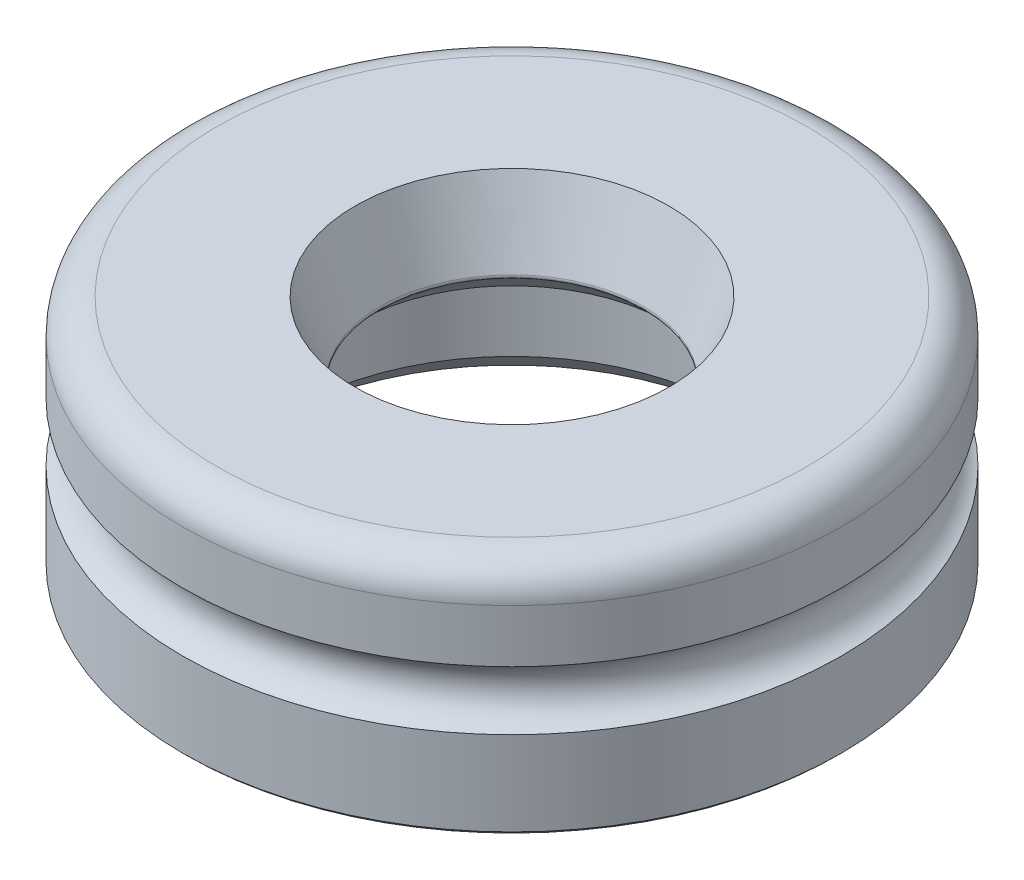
ISO-10303-21;
HEADER;
FILE_DESCRIPTION(('STEP AP214'),'2;1');
FILE_NAME('part.step','',(''),(''),'','','');
FILE_SCHEMA(('AUTOMOTIVE_DESIGN { 1 0 10303 214 1 1 1 1 }'));
ENDSEC;
DATA;
#1=APPLICATION_CONTEXT('core data for automotive mechanical design processes');
#2=APPLICATION_PROTOCOL_DEFINITION('international standard','automotive_design',2000,#1);
#3=PRODUCT_CONTEXT('',#1,'mechanical');
#4=PRODUCT('Part','Part','',(#3));
#5=PRODUCT_RELATED_PRODUCT_CATEGORY('part','',(#4));
#6=PRODUCT_DEFINITION_FORMATION('','',#4);
#7=PRODUCT_DEFINITION_CONTEXT('part definition',#1,'design');
#8=PRODUCT_DEFINITION('design','',#6,#7);
#9=PRODUCT_DEFINITION_SHAPE('','',#8);
#10=(LENGTH_UNIT() NAMED_UNIT(*) SI_UNIT(.MILLI.,.METRE.));
#11=(NAMED_UNIT(*) PLANE_ANGLE_UNIT() SI_UNIT($,.RADIAN.));
#12=(NAMED_UNIT(*) SI_UNIT($,.STERADIAN.) SOLID_ANGLE_UNIT());
#13=UNCERTAINTY_MEASURE_WITH_UNIT(LENGTH_MEASURE(1.E-05),#10,'distance_accuracy_value','');
#14=(GEOMETRIC_REPRESENTATION_CONTEXT(3) GLOBAL_UNCERTAINTY_ASSIGNED_CONTEXT((#13)) GLOBAL_UNIT_ASSIGNED_CONTEXT((#10,
#11,#12)) REPRESENTATION_CONTEXT('',''));
#15=CARTESIAN_POINT('',(0.,0.,0.));
#16=DIRECTION('',(0.,0.,1.));
#17=DIRECTION('',(1.,0.,0.));
#18=AXIS2_PLACEMENT_3D('',#15,#16,#17);
#19=CARTESIAN_POINT('',(0.,0.,0.));
#20=DIRECTION('',(0.,-1.,0.));
#21=DIRECTION('',(0.,0.,-1.));
#22=AXIS2_PLACEMENT_3D('',#19,#20,#21);
#23=CYLINDRICAL_SURFACE('',#22,19.);
#24=CARTESIAN_POINT('',(0.,0.700000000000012,0.));
#25=DIRECTION('',(0.,1.,0.));
#26=DIRECTION('',(0.,0.,1.));
#27=AXIS2_PLACEMENT_3D('',#24,#25,#26);
#28=CIRCLE('',#27,19.);
#29=CARTESIAN_POINT('',(0.,0.700000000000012,19.));
#30=VERTEX_POINT('',#29);
#31=EDGE_CURVE('E10',#30,#30,#28,.T.);
#32=ORIENTED_EDGE('',*,*,#31,.T.);
#33=EDGE_LOOP('',(#32));
#34=FACE_BOUND('',#33,.T.);
#35=CARTESIAN_POINT('',(0.,5.55294372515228,0.));
#36=DIRECTION('',(0.,1.,0.));
#37=DIRECTION('',(0.,0.,1.));
#38=AXIS2_PLACEMENT_3D('',#35,#36,#37);
#39=CIRCLE('',#38,19.);
#40=CARTESIAN_POINT('',(0.,5.55294372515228,19.));
#41=VERTEX_POINT('',#40);
#42=EDGE_CURVE('E48',#41,#41,#39,.T.);
#43=ORIENTED_EDGE('',*,*,#42,.F.);
#44=EDGE_LOOP('',(#43));
#45=FACE_BOUND('',#44,.T.);
#46=ADVANCED_FACE('F30',(#34,#45),#23,.T.);
#47=CARTESIAN_POINT('',(0.,12.,0.));
#48=DIRECTION('',(0.,-1.,0.));
#49=DIRECTION('',(0.,0.,-1.));
#50=AXIS2_PLACEMENT_3D('',#47,#48,#49);
#51=CIRCLE('',#50,19.);
#52=CARTESIAN_POINT('',(0.,12.,-19.));
#53=VERTEX_POINT('',#52);
#54=EDGE_CURVE('E60',#53,#53,#51,.T.);
#55=ORIENTED_EDGE('',*,*,#54,.T.);
#56=EDGE_LOOP('',(#55));
#57=FACE_BOUND('',#56,.T.);
#58=CARTESIAN_POINT('',(0.,8.94705627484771,0.));
#59=DIRECTION('',(0.,-1.,0.));
#60=DIRECTION('',(0.,0.,-1.));
#61=AXIS2_PLACEMENT_3D('',#58,#59,#60);
#62=CIRCLE('',#61,19.);
#63=CARTESIAN_POINT('',(0.,8.94705627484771,-19.));
#64=VERTEX_POINT('',#63);
#65=EDGE_CURVE('E52',#64,#64,#62,.T.);
#66=ORIENTED_EDGE('',*,*,#65,.F.);
#67=EDGE_LOOP('',(#66));
#68=FACE_BOUND('',#67,.T.);
#69=ADVANCED_FACE('F99',(#57,#68),#23,.T.);
#70=CARTESIAN_POINT('',(-19.,0.499999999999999,0.));
#71=DIRECTION('',(0.,1.,0.));
#72=DIRECTION('',(0.,0.,1.));
#73=AXIS2_PLACEMENT_3D('',#70,#71,#72);
#74=PLANE('',#73);
#75=CARTESIAN_POINT('',(0.,0.499999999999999,0.));
#76=DIRECTION('',(0.,1.,0.));
#77=DIRECTION('',(0.,0.,1.));
#78=AXIS2_PLACEMENT_3D('',#75,#76,#77);
#79=CIRCLE('',#78,18.8);
#80=CARTESIAN_POINT('',(0.,0.499999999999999,18.8));
#81=VERTEX_POINT('',#80);
#82=EDGE_CURVE('E37',#81,#81,#79,.F.);
#83=ORIENTED_EDGE('',*,*,#82,.T.);
#84=EDGE_LOOP('',(#83));
#85=FACE_BOUND('',#84,.T.);
#86=CARTESIAN_POINT('',(0.,0.499999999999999,0.));
#87=DIRECTION('',(0.,1.,0.));
#88=DIRECTION('',(0.,0.,1.));
#89=AXIS2_PLACEMENT_3D('',#86,#87,#88);
#90=CIRCLE('',#89,14.25);
#91=CARTESIAN_POINT('',(0.,0.499999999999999,14.25));
#92=VERTEX_POINT('',#91);
#93=EDGE_CURVE('E41',#92,#92,#90,.T.);
#94=ORIENTED_EDGE('',*,*,#93,.T.);
#95=EDGE_LOOP('',(#94));
#96=FACE_BOUND('',#95,.T.);
#97=ADVANCED_FACE('F104',(#85,#96),#74,.F.);
#98=CARTESIAN_POINT('',(0.,0.,0.));
#99=DIRECTION('',(0.,-1.,0.));
#100=DIRECTION('',(0.,0.,-1.));
#101=AXIS2_PLACEMENT_3D('',#98,#99,#100);
#102=CYLINDRICAL_SURFACE('',#101,12.75);
#103=CARTESIAN_POINT('',(0.,2.00000000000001,0.));
#104=DIRECTION('',(0.,1.,0.));
#105=DIRECTION('',(0.,0.,1.));
#106=AXIS2_PLACEMENT_3D('',#103,#104,#105);
#107=CIRCLE('',#106,12.75);
#108=CARTESIAN_POINT('',(0.,2.00000000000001,12.75));
#109=VERTEX_POINT('',#108);
#110=EDGE_CURVE('E45',#109,#109,#107,.F.);
#111=ORIENTED_EDGE('',*,*,#110,.T.);
#112=EDGE_LOOP('',(#111));
#113=FACE_BOUND('',#112,.T.);
#114=CARTESIAN_POINT('',(0.,8.,0.));
#115=DIRECTION('',(0.,-1.,0.));
#116=DIRECTION('',(0.,0.,-1.));
#117=AXIS2_PLACEMENT_3D('',#114,#115,#116);
#118=CIRCLE('',#117,12.75);
#119=CARTESIAN_POINT('',(0.,8.,-12.75));
#120=VERTEX_POINT('',#119);
#121=EDGE_CURVE('E75',#120,#120,#118,.T.);
#122=ORIENTED_EDGE('',*,*,#121,.F.);
#123=EDGE_LOOP('',(#122));
#124=FACE_BOUND('',#123,.T.);
#125=ADVANCED_FACE('F133',(#113,#124),#102,.F.);
#126=CARTESIAN_POINT('',(-12.75,8.,0.));
#127=DIRECTION('',(0.,1.,0.));
#128=DIRECTION('',(0.,0.,1.));
#129=AXIS2_PLACEMENT_3D('',#126,#127,#128);
#130=PLANE('',#129);
#131=CARTESIAN_POINT('',(0.,8.,0.));
#132=DIRECTION('',(0.,1.,0.));
#133=DIRECTION('',(0.,0.,1.));
#134=AXIS2_PLACEMENT_3D('',#131,#132,#133);
#135=CIRCLE('',#134,9.30161276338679);
#136=CARTESIAN_POINT('',(0.,8.,9.30161276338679));
#137=VERTEX_POINT('',#136);
#138=EDGE_CURVE('E66',#137,#137,#135,.T.);
#139=ORIENTED_EDGE('',*,*,#138,.T.);
#140=EDGE_LOOP('',(#139));
#141=FACE_BOUND('',#140,.T.);
#142=ORIENTED_EDGE('',*,*,#121,.T.);
#143=EDGE_LOOP('',(#142));
#144=FACE_BOUND('',#143,.T.);
#145=ADVANCED_FACE('F95',(#141,#144),#130,.F.);
#146=CARTESIAN_POINT('',(0.,0.,0.));
#147=DIRECTION('',(0.,-1.,0.));
#148=DIRECTION('',(-1.,0.,0.));
#149=AXIS2_PLACEMENT_3D('',#146,#147,#148);
#150=SPHERICAL_SURFACE('',#149,12.2);
#151=CARTESIAN_POINT('',(0.,8.06774193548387,0.));
#152=DIRECTION('',(0.,-1.,0.));
#153=DIRECTION('',(0.,0.,-1.));
#154=AXIS2_PLACEMENT_3D('',#151,#152,#153);
#155=CIRCLE('',#154,9.1515867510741);
#156=CARTESIAN_POINT('',(-9.1515867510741,8.06774193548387,0.));
#157=VERTEX_POINT('',#156);
#158=EDGE_CURVE('E69',#157,#157,#155,.T.);
#159=CARTESIAN_POINT('',(0.,9.50815263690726,0.));
#160=DIRECTION('',(0.,-1.,0.));
#161=DIRECTION('',(0.,0.,-1.));
#162=AXIS2_PLACEMENT_3D('',#159,#160,#161);
#163=CIRCLE('',#162,7.64428109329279);
#164=CARTESIAN_POINT('',(-7.64428109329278,9.50815263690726,0.));
#165=VERTEX_POINT('',#164);
#166=EDGE_CURVE('E72',#165,#165,#163,.F.);
#167=CARTESIAN_POINT('',(-9.1515867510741,8.06774193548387,0.));
#168=CARTESIAN_POINT('',(-9.1372075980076,8.08405282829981,0.));
#169=CARTESIAN_POINT('',(-9.12278483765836,8.10032527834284,0.));
#170=CARTESIAN_POINT('',(-9.09385251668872,8.13279282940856,0.));
#171=CARTESIAN_POINT('',(-9.07934295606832,8.14898793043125,0.));
#172=CARTESIAN_POINT('',(-9.05023744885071,8.18130031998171,0.));
#173=CARTESIAN_POINT('',(-9.0356415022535,8.19741760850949,0.));
#174=CARTESIAN_POINT('',(-9.00636364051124,8.22957391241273,0.));
#175=CARTESIAN_POINT('',(-8.99168172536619,8.2456129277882,0.));
#176=CARTESIAN_POINT('',(-8.96223234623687,8.2776122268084,0.));
#177=CARTESIAN_POINT('',(-8.94746488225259,8.29357251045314,0.));
#178=CARTESIAN_POINT('',(-8.91784482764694,8.32541388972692,0.));
#179=CARTESIAN_POINT('',(-8.90299223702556,8.34129498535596,0.));
#180=CARTESIAN_POINT('',(-8.87320235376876,8.37297753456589,0.));
#181=CARTESIAN_POINT('',(-8.85826506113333,8.38877898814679,0.));
#182=CARTESIAN_POINT('',(-8.82830620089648,8.42030180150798,0.));
#183=CARTESIAN_POINT('',(-8.81328463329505,8.43602316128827,0.));
#184=CARTESIAN_POINT('',(-8.7831576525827,8.46738533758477,0.));
#185=CARTESIAN_POINT('',(-8.76805223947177,8.48302615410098,0.));
#186=CARTESIAN_POINT('',(-8.73775799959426,8.51422679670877,0.));
#187=CARTESIAN_POINT('',(-8.72256917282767,8.52978662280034,0.));
#188=CARTESIAN_POINT('',(-8.69210853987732,8.56082483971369,0.));
#189=CARTESIAN_POINT('',(-8.67683673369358,8.57630323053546,0.));
#190=CARTESIAN_POINT('',(-8.64621057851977,8.60717813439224,0.));
#191=CARTESIAN_POINT('',(-8.63085622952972,8.62257464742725,0.));
#192=CARTESIAN_POINT('',(-8.600065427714,8.65328535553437,0.));
#193=CARTESIAN_POINT('',(-8.58462897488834,8.66859955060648,0.));
#194=CARTESIAN_POINT('',(-8.55367440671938,8.69914518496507,0.));
#195=CARTESIAN_POINT('',(-8.5381562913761,8.71437662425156,0.));
#196=CARTESIAN_POINT('',(-8.50703884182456,8.74475631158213,0.));
#197=CARTESIAN_POINT('',(-8.49143950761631,8.75990455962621,0.));
#198=CARTESIAN_POINT('',(-8.46016006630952,8.79011743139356,0.));
#199=CARTESIAN_POINT('',(-8.44447995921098,8.80518205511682,0.));
#200=CARTESIAN_POINT('',(-8.41303942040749,8.83522724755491,0.));
#201=CARTESIAN_POINT('',(-8.39727898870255,8.85020781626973,0.));
#202=CARTESIAN_POINT('',(-8.3656782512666,8.88008447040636,0.));
#203=CARTESIAN_POINT('',(-8.34983794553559,8.89498055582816,0.));
#204=CARTESIAN_POINT('',(-8.31807791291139,8.92468781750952,0.));
#205=CARTESIAN_POINT('',(-8.30215818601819,8.93949899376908,0.));
#206=CARTESIAN_POINT('',(-8.27023976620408,8.96903601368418,0.));
#207=CARTESIAN_POINT('',(-8.25424107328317,8.98376185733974,0.));
#208=CARTESIAN_POINT('',(-8.22216517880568,9.01312779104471,0.));
#209=CARTESIAN_POINT('',(-8.20608797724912,9.02776788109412,0.));
#210=CARTESIAN_POINT('',(-8.1738555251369,9.05696188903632,0.));
#211=CARTESIAN_POINT('',(-8.15770027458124,9.07151580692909,0.));
#212=CARTESIAN_POINT('',(-8.12531218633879,9.1005370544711,0.));
#213=CARTESIAN_POINT('',(-8.10907934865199,9.11500438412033,0.));
#214=CARTESIAN_POINT('',(-8.07653655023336,9.14385204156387,0.));
#215=CARTESIAN_POINT('',(-8.06022658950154,9.15823236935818,0.));
#216=CARTESIAN_POINT('',(-8.02753001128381,9.18690561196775,0.));
#217=CARTESIAN_POINT('',(-8.01114339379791,9.20119852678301,0.));
#218=CARTESIAN_POINT('',(-7.97829397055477,9.22969653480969,0.));
#219=CARTESIAN_POINT('',(-7.96183116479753,9.24390162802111,0.));
#220=CARTESIAN_POINT('',(-7.92882983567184,9.27222358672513,0.));
#221=CARTESIAN_POINT('',(-7.91229131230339,9.28634045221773,0.));
#222=CARTESIAN_POINT('',(-7.87913902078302,9.31448555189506,0.));
#223=CARTESIAN_POINT('',(-7.8625252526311,9.32851378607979,0.));
#224=CARTESIAN_POINT('',(-7.82922294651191,9.35648122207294,0.));
#225=CARTESIAN_POINT('',(-7.81253440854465,9.37042042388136,0.));
#226=CARTESIAN_POINT('',(-7.77908303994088,9.39820939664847,0.));
#227=CARTESIAN_POINT('',(-7.76232020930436,9.41205916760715,0.));
#228=CARTESIAN_POINT('',(-7.72872073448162,9.43966888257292,0.));
#229=CARTESIAN_POINT('',(-7.71188409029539,9.45342882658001,0.));
#230=CARTESIAN_POINT('',(-7.67813747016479,9.48085849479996,0.));
#231=CARTESIAN_POINT('',(-7.66122749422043,9.49452821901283,0.));
#232=CARTESIAN_POINT('',(-7.64428109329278,9.50815263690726,0.));
#233=B_SPLINE_CURVE_WITH_KNOTS('',3,(#167,#168,#169,#170,#171,#172,#173,#174,#175,#176,#177,
#178,#179,#180,#181,#182,#183,#184,#185,#186,#187,#188,#189,#190,#191,#192,#193,#194,#195,#196,
#197,#198,#199,#200,#201,#202,#203,#204,#205,#206,#207,#208,#209,#210,#211,#212,#213,#214,#215,
#216,#217,#218,#219,#220,#221,#222,#223,#224,#225,#226,#227,#228,#229,#230,#231,#232),
.UNSPECIFIED.,.F.,.F.,(4,2,2,2,2,2,2,2,2,2,2,2,2,2,2,2,2,2,2,2,2,2,2,2,2,2,2,2,2,2,2,2,4),(0.,
0.0652321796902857,0.130464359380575,0.195696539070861,0.260928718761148,0.326160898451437,
0.391393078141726,0.456625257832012,0.521857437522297,0.587089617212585,0.652321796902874,
0.717553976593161,0.782786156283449,0.848018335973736,0.913250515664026,0.978482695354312,
1.0437148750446,1.10894705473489,1.17417923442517,1.23941141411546,1.30464359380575,
1.36987577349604,1.43510795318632,1.50034013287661,1.5655723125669,1.63080449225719,
1.69603667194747,1.76126885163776,1.82650103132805,1.89173321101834,1.95696539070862,
2.02219757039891,2.0874297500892),.UNSPECIFIED.);
#234=EDGE_CURVE('BSEAM85',#157,#165,#233,.T.);
#235=ORIENTED_EDGE('',*,*,#158,.T.);
#236=ORIENTED_EDGE('',*,*,#166,.T.);
#237=ORIENTED_EDGE('',*,*,#234,.T.);
#238=ORIENTED_EDGE('',*,*,#234,.F.);
#239=EDGE_LOOP('',(#235,#237,#236,#238));
#240=FACE_BOUND('',#239,.T.);
#241=ADVANCED_FACE('F85',(#240),#150,.F.);
#242=CARTESIAN_POINT('',(0.,9.59541861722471,0.));
#243=DIRECTION('',(0.,1.,0.));
#244=DIRECTION('',(0.,0.,1.));
#245=AXIS2_PLACEMENT_3D('',#242,#243,#244);
#246=CONICAL_SURFACE('',#245,7.5344503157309,0.331612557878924);
#247=CARTESIAN_POINT('',(0.,9.72913762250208,0.));
#248=DIRECTION('',(0.,-1.,0.));
#249=DIRECTION('',(0.,0.,-1.));
#250=AXIS2_PLACEMENT_3D('',#247,#248,#249);
#251=CIRCLE('',#250,7.58049346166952);
#252=CARTESIAN_POINT('',(0.,9.72913762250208,-7.58049346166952));
#253=VERTEX_POINT('',#252);
#254=EDGE_CURVE('E63',#253,#253,#251,.T.);
#255=ORIENTED_EDGE('',*,*,#254,.T.);
#256=EDGE_LOOP('',(#255));
#257=FACE_BOUND('',#256,.T.);
#258=CARTESIAN_POINT('',(0.,14.,0.));
#259=DIRECTION('',(0.,-1.,0.));
#260=DIRECTION('',(0.,0.,-1.));
#261=AXIS2_PLACEMENT_3D('',#258,#259,#260);
#262=CIRCLE('',#261,9.05106931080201);
#263=CARTESIAN_POINT('',(0.,14.,-9.05106931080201));
#264=VERTEX_POINT('',#263);
#265=EDGE_CURVE('E51',#264,#264,#262,.T.);
#266=ORIENTED_EDGE('',*,*,#265,.F.);
#267=EDGE_LOOP('',(#266));
#268=FACE_BOUND('',#267,.T.);
#269=ADVANCED_FACE('F83',(#257,#268),#246,.F.);
#270=CARTESIAN_POINT('',(-19.,14.,0.));
#271=DIRECTION('',(0.,-1.,0.));
#272=DIRECTION('',(0.,0.,-1.));
#273=AXIS2_PLACEMENT_3D('',#270,#271,#272);
#274=PLANE('',#273);
#275=CARTESIAN_POINT('',(0.,14.,0.));
#276=DIRECTION('',(0.,-1.,0.));
#277=DIRECTION('',(0.,0.,-1.));
#278=AXIS2_PLACEMENT_3D('',#275,#276,#277);
#279=CIRCLE('',#278,17.);
#280=CARTESIAN_POINT('',(0.,14.,-17.));
#281=VERTEX_POINT('',#280);
#282=EDGE_CURVE('E57',#281,#281,#279,.F.);
#283=ORIENTED_EDGE('',*,*,#282,.T.);
#284=EDGE_LOOP('',(#283));
#285=FACE_BOUND('',#284,.T.);
#286=ORIENTED_EDGE('',*,*,#265,.T.);
#287=EDGE_LOOP('',(#286));
#288=FACE_BOUND('',#287,.T.);
#289=ADVANCED_FACE('F81',(#285,#288),#274,.F.);
#290=CARTESIAN_POINT('',(0.,8.2,0.));
#291=DIRECTION('',(0.,1.,0.));
#292=DIRECTION('',(0.,0.,1.));
#293=AXIS2_PLACEMENT_3D('',#290,#291,#292);
#294=TOROIDAL_SURFACE('',#293,9.30161276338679,0.2);
#295=ORIENTED_EDGE('',*,*,#138,.F.);
#296=EDGE_LOOP('',(#295));
#297=FACE_BOUND('',#296,.T.);
#298=ORIENTED_EDGE('',*,*,#158,.F.);
#299=EDGE_LOOP('',(#298));
#300=FACE_BOUND('',#299,.T.);
#301=ADVANCED_FACE('F92',(#297,#300),#294,.T.);
#302=CARTESIAN_POINT('',(0.,9.66402399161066,0.));
#303=DIRECTION('',(0.,-1.,0.));
#304=DIRECTION('',(0.,0.,-1.));
#305=AXIS2_PLACEMENT_3D('',#302,#303,#304);
#306=TOROIDAL_SURFACE('',#305,7.76959717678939,0.2);
#307=ORIENTED_EDGE('',*,*,#166,.F.);
#308=EDGE_LOOP('',(#307));
#309=FACE_BOUND('',#308,.T.);
#310=ORIENTED_EDGE('',*,*,#254,.F.);
#311=EDGE_LOOP('',(#310));
#312=FACE_BOUND('',#311,.T.);
#313=ADVANCED_FACE('F112',(#309,#312),#306,.T.);
#314=CARTESIAN_POINT('',(0.,12.,0.));
#315=DIRECTION('',(0.,-1.,0.));
#316=DIRECTION('',(0.,0.,-1.));
#317=AXIS2_PLACEMENT_3D('',#314,#315,#316);
#318=TOROIDAL_SURFACE('',#317,17.,2.);
#319=ORIENTED_EDGE('',*,*,#282,.F.);
#320=EDGE_LOOP('',(#319));
#321=FACE_BOUND('',#320,.T.);
#322=ORIENTED_EDGE('',*,*,#54,.F.);
#323=EDGE_LOOP('',(#322));
#324=FACE_BOUND('',#323,.T.);
#325=ADVANCED_FACE('F116',(#321,#324),#318,.T.);
#326=CARTESIAN_POINT('',(0.,2.00000000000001,0.));
#327=DIRECTION('',(0.,-1.,0.));
#328=DIRECTION('',(0.,0.,-1.));
#329=AXIS2_PLACEMENT_3D('',#326,#327,#328);
#330=CONICAL_SURFACE('',#329,12.75,0.785398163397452);
#331=ORIENTED_EDGE('',*,*,#93,.F.);
#332=EDGE_LOOP('',(#331));
#333=FACE_BOUND('',#332,.T.);
#334=ORIENTED_EDGE('',*,*,#110,.F.);
#335=EDGE_LOOP('',(#334));
#336=FACE_BOUND('',#335,.T.);
#337=ADVANCED_FACE('F119',(#333,#336),#330,.F.);
#338=CARTESIAN_POINT('',(0.,7.25,0.));
#339=DIRECTION('',(0.,-1.,0.));
#340=DIRECTION('',(0.,0.,-1.));
#341=AXIS2_PLACEMENT_3D('',#338,#339,#340);
#342=TOROIDAL_SURFACE('',#341,19.6,1.8);
#343=ORIENTED_EDGE('',*,*,#65,.T.);
#344=EDGE_LOOP('',(#343));
#345=FACE_BOUND('',#344,.T.);
#346=ORIENTED_EDGE('',*,*,#42,.T.);
#347=EDGE_LOOP('',(#346));
#348=FACE_BOUND('',#347,.T.);
#349=ADVANCED_FACE('F122',(#345,#348),#342,.F.);
#350=CARTESIAN_POINT('',(0.,0.499999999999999,0.));
#351=DIRECTION('',(0.,1.,0.));
#352=DIRECTION('',(0.,0.,1.));
#353=AXIS2_PLACEMENT_3D('',#350,#351,#352);
#354=CONICAL_SURFACE('',#353,18.8,0.78539816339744);
#355=ORIENTED_EDGE('',*,*,#31,.F.);
#356=EDGE_LOOP('',(#355));
#357=FACE_BOUND('',#356,.T.);
#358=ORIENTED_EDGE('',*,*,#82,.F.);
#359=EDGE_LOOP('',(#358));
#360=FACE_BOUND('',#359,.T.);
#361=ADVANCED_FACE('F32',(#357,#360),#354,.T.);
#362=CLOSED_SHELL('',(#46,#69,#97,#125,#145,#241,#269,#289,#301,#313,#325,#337,#349,#361));
#363=MANIFOLD_SOLID_BREP('B2',#362);
#364=ADVANCED_BREP_SHAPE_REPRESENTATION('',(#18,#363),#14);
#365=SHAPE_DEFINITION_REPRESENTATION(#9,#364);
ENDSEC;
END-ISO-10303-21;
